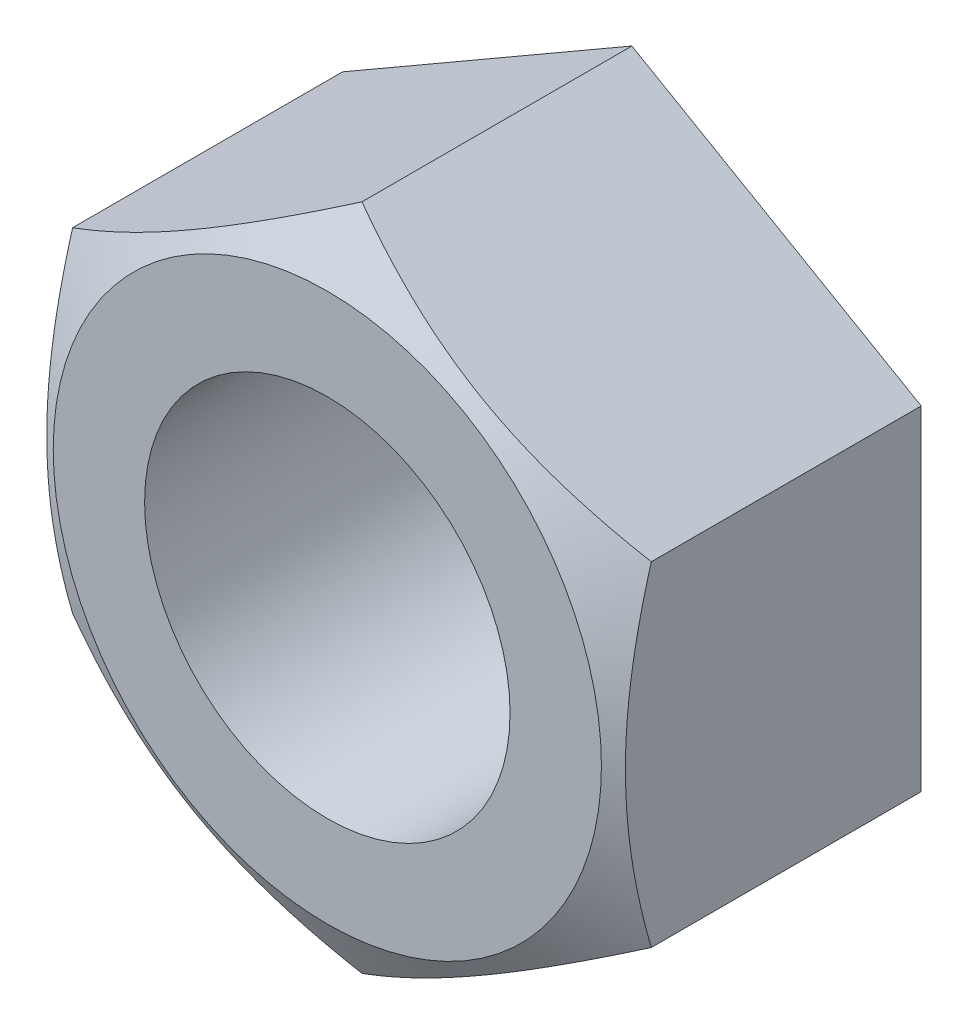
ISO-10303-21;
HEADER;
FILE_DESCRIPTION(('STEP AP214'),'2;1');
FILE_NAME('part.step','',(''),(''),'','','');
FILE_SCHEMA(('AUTOMOTIVE_DESIGN { 1 0 10303 214 1 1 1 1 }'));
ENDSEC;
DATA;
#1=APPLICATION_CONTEXT('core data for automotive mechanical design processes');
#2=APPLICATION_PROTOCOL_DEFINITION('international standard','automotive_design',2000,#1);
#3=PRODUCT_CONTEXT('',#1,'mechanical');
#4=PRODUCT('Part','Part','',(#3));
#5=PRODUCT_RELATED_PRODUCT_CATEGORY('part','',(#4));
#6=PRODUCT_DEFINITION_FORMATION('','',#4);
#7=PRODUCT_DEFINITION_CONTEXT('part definition',#1,'design');
#8=PRODUCT_DEFINITION('design','',#6,#7);
#9=PRODUCT_DEFINITION_SHAPE('','',#8);
#10=(LENGTH_UNIT() NAMED_UNIT(*) SI_UNIT(.MILLI.,.METRE.));
#11=(NAMED_UNIT(*) PLANE_ANGLE_UNIT() SI_UNIT($,.RADIAN.));
#12=(NAMED_UNIT(*) SI_UNIT($,.STERADIAN.) SOLID_ANGLE_UNIT());
#13=UNCERTAINTY_MEASURE_WITH_UNIT(LENGTH_MEASURE(1.E-05),#10,'distance_accuracy_value','');
#14=(GEOMETRIC_REPRESENTATION_CONTEXT(3) GLOBAL_UNCERTAINTY_ASSIGNED_CONTEXT((#13)) GLOBAL_UNIT_ASSIGNED_CONTEXT((#10,
#11,#12)) REPRESENTATION_CONTEXT('',''));
#15=CARTESIAN_POINT('',(0.,0.,0.));
#16=DIRECTION('',(0.,0.,1.));
#17=DIRECTION('',(1.,0.,0.));
#18=AXIS2_PLACEMENT_3D('',#15,#16,#17);
#19=CARTESIAN_POINT('',(-9.5,-5.48482755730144,10.));
#20=DIRECTION('',(-1.,0.,0.));
#21=DIRECTION('',(0.,0.,1.));
#22=AXIS2_PLACEMENT_3D('',#19,#20,#21);
#23=PLANE('',#22);
#24=DIRECTION('',(0.,1.,0.));
#25=VECTOR('',#24,1.);
#26=CARTESIAN_POINT('',(-9.5,-5.48482755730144,0.));
#27=LINE('',#26,#25);
#28=CARTESIAN_POINT('',(-9.5,-5.48482755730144,0.));
#29=VERTEX_POINT('',#28);
#30=CARTESIAN_POINT('',(-9.5,5.48482755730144,0.));
#31=VERTEX_POINT('',#30);
#32=EDGE_CURVE('E90',#29,#31,#27,.T.);
#33=ORIENTED_EDGE('',*,*,#32,.F.);
#34=DIRECTION('',(0.,0.,-1.));
#35=VECTOR('',#34,1.);
#36=CARTESIAN_POINT('',(-9.5,-5.48482755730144,10.));
#37=LINE('',#36,#35);
#38=CARTESIAN_POINT('',(-9.5,-5.48482755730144,8.86281908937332));
#39=VERTEX_POINT('',#38);
#40=EDGE_CURVE('E9',#39,#29,#37,.T.);
#41=ORIENTED_EDGE('',*,*,#40,.F.);
#42=CARTESIAN_POINT('',(-9.5,-14.6203705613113,5.12961982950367));
#43=CARTESIAN_POINT('',(-9.5,-14.4133760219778,5.22982896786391));
#44=CARTESIAN_POINT('',(-9.5,-14.2061355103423,5.32952978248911));
#45=CARTESIAN_POINT('',(-9.5,-13.7911111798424,5.52779940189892));
#46=CARTESIAN_POINT('',(-9.5,-13.5833273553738,5.62636819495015));
#47=CARTESIAN_POINT('',(-9.5,-12.959026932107,5.92023022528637));
#48=CARTESIAN_POINT('',(-9.5,-12.5416243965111,6.11364852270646));
#49=CARTESIAN_POINT('',(-9.5,-11.7016619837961,6.49535955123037));
#50=CARTESIAN_POINT('',(-9.5,-11.279086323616,6.68361763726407));
#51=CARTESIAN_POINT('',(-9.5,-10.4305349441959,7.05228047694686));
#52=CARTESIAN_POINT('',(-9.5,-10.004559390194,7.23268560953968));
#53=CARTESIAN_POINT('',(-9.5,-9.13523598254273,7.58900936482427));
#54=CARTESIAN_POINT('',(-9.5,-8.69175917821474,7.7646151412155));
#55=CARTESIAN_POINT('',(-9.5,-7.79957695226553,8.10226180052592));
#56=CARTESIAN_POINT('',(-9.5,-7.3508709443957,8.26430114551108));
#57=CARTESIAN_POINT('',(-9.5,-6.44838780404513,8.57047760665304));
#58=CARTESIAN_POINT('',(-9.5,-5.99462344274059,8.71465195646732));
#59=CARTESIAN_POINT('',(-9.5,-5.08060402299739,8.98040038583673));
#60=CARTESIAN_POINT('',(-9.5,-4.62035109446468,9.10198170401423));
#61=CARTESIAN_POINT('',(-9.5,-3.69554066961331,9.31598884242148));
#62=CARTESIAN_POINT('',(-9.5,-3.23101965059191,9.40856799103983));
#63=CARTESIAN_POINT('',(-9.5,-2.53009968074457,9.52161967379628));
#64=CARTESIAN_POINT('',(-9.5,-2.29575188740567,9.55500229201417));
#65=CARTESIAN_POINT('',(-9.5,-1.82593015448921,9.61250466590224));
#66=CARTESIAN_POINT('',(-9.5,-1.59045632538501,9.63662531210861));
#67=CARTESIAN_POINT('',(-9.5,-1.12172453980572,9.67482643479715));
#68=CARTESIAN_POINT('',(-9.5,-0.888476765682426,9.68903138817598));
#69=CARTESIAN_POINT('',(-9.5,-0.421589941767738,9.70757316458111));
#70=CARTESIAN_POINT('',(-9.5,-0.187950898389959,9.7119101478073));
#71=CARTESIAN_POINT('',(-9.5,0.279302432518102,9.710612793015));
#72=CARTESIAN_POINT('',(-9.5,0.512916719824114,9.70497837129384));
#73=CARTESIAN_POINT('',(-9.5,0.979703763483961,9.68387374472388));
#74=CARTESIAN_POINT('',(-9.5,1.21287649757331,9.66840305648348));
#75=CARTESIAN_POINT('',(-9.5,1.7767093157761,9.61942455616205));
#76=CARTESIAN_POINT('',(-9.5,2.10695454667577,9.58105864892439));
#77=CARTESIAN_POINT('',(-9.5,2.76492123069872,9.48671274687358));
#78=CARTESIAN_POINT('',(-9.5,3.09264232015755,9.43073026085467));
#79=CARTESIAN_POINT('',(-9.5,3.74527313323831,9.30314290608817));
#80=CARTESIAN_POINT('',(-9.5,4.07018038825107,9.23152552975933));
#81=CARTESIAN_POINT('',(-9.5,4.71670052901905,9.0748470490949));
#82=CARTESIAN_POINT('',(-9.5,5.03831347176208,8.98978617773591));
#83=CARTESIAN_POINT('',(-9.5,5.68526467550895,8.80628787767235));
#84=CARTESIAN_POINT('',(-9.5,6.01053116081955,8.70759912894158));
#85=CARTESIAN_POINT('',(-9.5,6.65785880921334,8.50026912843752));
#86=CARTESIAN_POINT('',(-9.5,6.97991995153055,8.39162781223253));
#87=CARTESIAN_POINT('',(-9.5,7.6210004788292,8.16609623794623));
#88=CARTESIAN_POINT('',(-9.5,7.94002088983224,8.04920888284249));
#89=CARTESIAN_POINT('',(-9.5,8.5754344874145,7.80853638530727));
#90=CARTESIAN_POINT('',(-9.5,8.89182770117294,7.68475131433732));
#91=CARTESIAN_POINT('',(-9.5,9.62350368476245,7.3907636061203));
#92=CARTESIAN_POINT('',(-9.5,10.0379237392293,7.21841738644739));
#93=CARTESIAN_POINT('',(-9.5,10.8633742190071,6.86576825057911));
#94=CARTESIAN_POINT('',(-9.5,11.2744044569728,6.68546489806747));
#95=CARTESIAN_POINT('',(-9.5,12.0936880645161,6.31845543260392));
#96=CARTESIAN_POINT('',(-9.5,12.5019408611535,6.13174804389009));
#97=CARTESIAN_POINT('',(-9.5,13.3160389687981,5.7531881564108));
#98=CARTESIAN_POINT('',(-9.5,13.7218843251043,5.56133575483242));
#99=CARTESIAN_POINT('',(-9.5,14.5319664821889,5.17323028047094));
#100=CARTESIAN_POINT('',(-9.5,14.9362012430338,4.9769729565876));
#101=CARTESIAN_POINT('',(-9.5,15.7429612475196,4.58097715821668));
#102=CARTESIAN_POINT('',(-9.5,16.145486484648,4.38123867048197));
#103=CARTESIAN_POINT('',(-9.5,17.3508043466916,3.77775226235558));
#104=CARTESIAN_POINT('',(-9.5,18.1514351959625,3.36968700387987));
#105=CARTESIAN_POINT('',(-9.5,19.6840581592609,2.5786437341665));
#106=CARTESIAN_POINT('',(-9.5,20.4163776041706,2.19629716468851));
#107=CARTESIAN_POINT('',(-9.5,21.8782922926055,1.42637873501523));
#108=CARTESIAN_POINT('',(-9.5,22.607887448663,1.03880670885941));
#109=CARTESIAN_POINT('',(-9.5,24.0632507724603,0.260571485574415));
#110=CARTESIAN_POINT('',(-9.5,24.7890238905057,-0.130082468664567));
#111=CARTESIAN_POINT('',(-9.5,26.2388196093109,-0.914537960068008));
#112=CARTESIAN_POINT('',(-9.5,26.9628422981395,-1.30833933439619));
#113=CARTESIAN_POINT('',(-9.5,27.686216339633,-1.70332069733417));
#114=B_SPLINE_CURVE_WITH_KNOTS('',3,(#42,#43,#44,#45,#46,#47,#48,#49,#50,#51,#52,#53,#54,#55,
#56,#57,#58,#59,#60,#61,#62,#63,#64,#65,#66,#67,#68,#69,#70,#71,#72,#73,#74,#75,#76,#77,#78,#79,
#80,#81,#82,#83,#84,#85,#86,#87,#88,#89,#90,#91,#92,#93,#94,#95,#96,#97,#98,#99,#100,#101,#102,
#103,#104,#105,#106,#107,#108,#109,#110,#111,#112,#113),.UNSPECIFIED.,.F.,.F.,(4,2,2,2,2,2,2,2,
2,2,2,2,2,2,2,2,2,2,2,2,2,2,2,2,2,2,2,2,2,2,2,2,2,2,2,4),(0.,0.689924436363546,1.37985601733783,
2.7599293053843,4.14770758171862,5.53541881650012,6.9661840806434,8.39711132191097,
9.82500423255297,11.2524388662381,12.6721943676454,13.38218061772,14.0920985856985,
14.7929360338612,15.4937621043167,16.1945940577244,16.8954604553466,17.8923053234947,
18.8892912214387,19.8870776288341,20.8848467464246,21.9043812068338,22.9239222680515,
23.9431061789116,24.9622795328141,26.3086543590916,27.6551031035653,29.0018216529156,
30.348514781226,31.6965687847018,33.0446279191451,35.7404261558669,38.2187752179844,
40.6972031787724,43.1698886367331,45.6424469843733),.UNSPECIFIED.);
#115=CARTESIAN_POINT('',(-9.5,5.48482755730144,8.86281908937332));
#116=VERTEX_POINT('',#115);
#117=EDGE_CURVE('E36',#39,#116,#114,.T.);
#118=ORIENTED_EDGE('',*,*,#117,.T.);
#119=DIRECTION('',(0.,0.,-1.));
#120=VECTOR('',#119,1.);
#121=CARTESIAN_POINT('',(-9.5,5.48482755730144,10.));
#122=LINE('',#121,#120);
#123=EDGE_CURVE('E76',#116,#31,#122,.T.);
#124=ORIENTED_EDGE('',*,*,#123,.T.);
#125=EDGE_LOOP('',(#33,#41,#118,#124));
#126=FACE_BOUND('',#125,.T.);
#127=ADVANCED_FACE('F14',(#126),#23,.T.);
#128=CARTESIAN_POINT('',(-9.5,-5.48482755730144,10.));
#129=DIRECTION('',(0.5,0.86602540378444,0.));
#130=DIRECTION('',(-0.86602540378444,0.5,0.));
#131=AXIS2_PLACEMENT_3D('',#128,#129,#130);
#132=PLANE('',#131);
#133=DIRECTION('',(-0.86602540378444,0.5,0.));
#134=VECTOR('',#133,1.);
#135=CARTESIAN_POINT('',(0.,-10.9696551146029,0.));
#136=LINE('',#135,#134);
#137=CARTESIAN_POINT('',(0.,-10.9696551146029,0.));
#138=VERTEX_POINT('',#137);
#139=EDGE_CURVE('E97',#138,#29,#136,.T.);
#140=ORIENTED_EDGE('',*,*,#139,.F.);
#141=DIRECTION('',(0.,0.,-1.));
#142=VECTOR('',#141,1.);
#143=CARTESIAN_POINT('',(0.,-10.9696551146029,10.));
#144=LINE('',#143,#142);
#145=CARTESIAN_POINT('',(0.,-10.9696551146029,8.86281908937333));
#146=VERTEX_POINT('',#145);
#147=EDGE_CURVE('E23',#146,#138,#144,.T.);
#148=ORIENTED_EDGE('',*,*,#147,.F.);
#149=CARTESIAN_POINT('',(-9.5002,-5.4847120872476,8.86275242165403));
#150=CARTESIAN_POINT('',(-9.2913692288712,-5.60528058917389,8.93235142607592));
#151=CARTESIAN_POINT('',(-9.08175982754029,-5.72629863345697,8.99879155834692));
#152=CARTESIAN_POINT('',(-8.66086011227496,-5.96930519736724,9.1244775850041));
#153=CARTESIAN_POINT('',(-8.44956926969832,-6.09129402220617,9.18372111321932));
#154=CARTESIAN_POINT('',(-7.81229220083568,-6.45922610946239,9.34951029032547));
#155=CARTESIAN_POINT('',(-7.38379023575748,-6.70662183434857,9.4438104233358));
#156=CARTESIAN_POINT('',(-6.74255666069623,-7.07683821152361,9.55438616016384));
#157=CARTESIAN_POINT('',(-6.53174078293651,-7.19855281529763,9.58588503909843));
#158=CARTESIAN_POINT('',(-6.10913296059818,-7.4425455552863,9.63870666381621));
#159=CARTESIAN_POINT('',(-5.89734099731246,-7.56482370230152,9.66002921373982));
#160=CARTESIAN_POINT('',(-5.47340378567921,-7.80958396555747,9.69195184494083));
#161=CARTESIAN_POINT('',(-5.26125925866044,-7.93206566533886,9.70256466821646));
#162=CARTESIAN_POINT('',(-4.83677424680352,-8.17714220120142,9.71284233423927));
#163=CARTESIAN_POINT('',(-4.62443376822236,-8.2997370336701,9.71250751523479));
#164=CARTESIAN_POINT('',(-4.22745800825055,-8.52893109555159,9.70165149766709));
#165=CARTESIAN_POINT('',(-4.04279470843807,-8.63554650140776,9.69245459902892));
#166=CARTESIAN_POINT('',(-3.67389999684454,-8.84852796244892,9.66595946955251));
#167=CARTESIAN_POINT('',(-3.48966861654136,-8.95489399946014,9.64866066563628));
#168=CARTESIAN_POINT('',(-2.937688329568,-9.27357996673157,9.58502038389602));
#169=CARTESIAN_POINT('',(-2.57091646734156,-9.48533580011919,9.52694296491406));
#170=CARTESIAN_POINT('',(-1.83348217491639,-9.91109368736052,9.38174885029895));
#171=CARTESIAN_POINT('',(-1.46291385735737,-10.1250414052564,9.29401669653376));
#172=CARTESIAN_POINT('',(-0.727303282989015,-10.5497463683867,9.09490112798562));
#173=CARTESIAN_POINT('',(-0.36225160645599,-10.7605090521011,8.98356447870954));
#174=CARTESIAN_POINT('',(0.000200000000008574,-10.9697705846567,8.86275242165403));
#175=B_SPLINE_CURVE_WITH_KNOTS('',3,(#149,#150,#151,#152,#153,#154,#155,#156,#157,#158,#159,
#160,#161,#162,#163,#164,#165,#166,#167,#168,#169,#170,#171,#172,#173,#174),.UNSPECIFIED.,.F.,
.F.,(4,2,2,2,2,2,2,2,2,2,2,2,4),(0.,0.752880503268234,1.50600787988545,3.0154687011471,
3.75167336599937,4.48789219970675,5.22323407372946,5.95855322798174,6.5986808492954,
7.23885375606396,8.52010929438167,9.82978009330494,11.1368800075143),.UNSPECIFIED.);
#176=EDGE_CURVE('E144',#39,#146,#175,.T.);
#177=ORIENTED_EDGE('',*,*,#176,.F.);
#178=ORIENTED_EDGE('',*,*,#40,.T.);
#179=EDGE_LOOP('',(#140,#148,#177,#178));
#180=FACE_BOUND('',#179,.T.);
#181=ADVANCED_FACE('F16',(#180),#132,.F.);
#182=CARTESIAN_POINT('',(9.5,-5.48482755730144,10.));
#183=DIRECTION('',(0.5,-0.86602540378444,0.));
#184=DIRECTION('',(0.86602540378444,0.5,0.));
#185=AXIS2_PLACEMENT_3D('',#182,#183,#184);
#186=PLANE('',#185);
#187=DIRECTION('',(-0.866025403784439,-0.5,0.));
#188=VECTOR('',#187,1.);
#189=CARTESIAN_POINT('',(9.5,-5.48482755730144,0.));
#190=LINE('',#189,#188);
#191=CARTESIAN_POINT('',(9.5,-5.48482755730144,0.));
#192=VERTEX_POINT('',#191);
#193=EDGE_CURVE('E94',#192,#138,#190,.T.);
#194=ORIENTED_EDGE('',*,*,#193,.F.);
#195=DIRECTION('',(0.,0.,-1.));
#196=VECTOR('',#195,1.);
#197=CARTESIAN_POINT('',(9.5,-5.48482755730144,10.));
#198=LINE('',#197,#196);
#199=CARTESIAN_POINT('',(9.5,-5.48482755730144,8.86281908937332));
#200=VERTEX_POINT('',#199);
#201=EDGE_CURVE('E178',#200,#192,#198,.T.);
#202=ORIENTED_EDGE('',*,*,#201,.F.);
#203=CARTESIAN_POINT('',(9.5002,-5.4847120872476,8.86275242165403));
#204=CARTESIAN_POINT('',(9.2913692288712,-5.60528058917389,8.93235142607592));
#205=CARTESIAN_POINT('',(9.08175982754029,-5.72629863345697,8.99879155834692));
#206=CARTESIAN_POINT('',(8.66086011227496,-5.96930519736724,9.1244775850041));
#207=CARTESIAN_POINT('',(8.44956926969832,-6.09129402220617,9.18372111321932));
#208=CARTESIAN_POINT('',(7.81229220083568,-6.45922610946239,9.34951029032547));
#209=CARTESIAN_POINT('',(7.38379023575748,-6.70662183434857,9.4438104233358));
#210=CARTESIAN_POINT('',(6.74255666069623,-7.07683821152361,9.55438616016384));
#211=CARTESIAN_POINT('',(6.53174078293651,-7.19855281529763,9.58588503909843));
#212=CARTESIAN_POINT('',(6.10913296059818,-7.4425455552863,9.63870666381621));
#213=CARTESIAN_POINT('',(5.89734099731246,-7.56482370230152,9.66002921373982));
#214=CARTESIAN_POINT('',(5.47340378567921,-7.80958396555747,9.69195184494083));
#215=CARTESIAN_POINT('',(5.26125925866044,-7.93206566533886,9.70256466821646));
#216=CARTESIAN_POINT('',(4.83677424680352,-8.17714220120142,9.71284233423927));
#217=CARTESIAN_POINT('',(4.62443376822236,-8.2997370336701,9.71250751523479));
#218=CARTESIAN_POINT('',(4.22745800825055,-8.52893109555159,9.70165149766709));
#219=CARTESIAN_POINT('',(4.04279470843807,-8.63554650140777,9.69245459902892));
#220=CARTESIAN_POINT('',(3.67389999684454,-8.84852796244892,9.66595946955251));
#221=CARTESIAN_POINT('',(3.48966861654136,-8.95489399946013,9.64866066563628));
#222=CARTESIAN_POINT('',(2.937688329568,-9.27357996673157,9.58502038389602));
#223=CARTESIAN_POINT('',(2.57091646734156,-9.48533580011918,9.52694296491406));
#224=CARTESIAN_POINT('',(1.83348217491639,-9.91109368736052,9.38174885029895));
#225=CARTESIAN_POINT('',(1.46291385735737,-10.1250414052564,9.29401669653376));
#226=CARTESIAN_POINT('',(0.727303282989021,-10.5497463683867,9.09490112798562));
#227=CARTESIAN_POINT('',(0.362251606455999,-10.7605090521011,8.98356447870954));
#228=CARTESIAN_POINT('',(-0.000200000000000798,-10.9697705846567,8.86275242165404));
#229=B_SPLINE_CURVE_WITH_KNOTS('',3,(#203,#204,#205,#206,#207,#208,#209,#210,#211,#212,#213,
#214,#215,#216,#217,#218,#219,#220,#221,#222,#223,#224,#225,#226,#227,#228),.UNSPECIFIED.,.F.,
.F.,(4,2,2,2,2,2,2,2,2,2,2,2,4),(0.,0.752880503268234,1.50600787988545,3.0154687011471,
3.75167336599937,4.48789219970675,5.22323407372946,5.95855322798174,6.5986808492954,
7.23885375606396,8.52010929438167,9.82978009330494,11.1368800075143),.UNSPECIFIED.);
#230=EDGE_CURVE('E138',#200,#146,#229,.T.);
#231=ORIENTED_EDGE('',*,*,#230,.T.);
#232=ORIENTED_EDGE('',*,*,#147,.T.);
#233=EDGE_LOOP('',(#194,#202,#231,#232));
#234=FACE_BOUND('',#233,.T.);
#235=ADVANCED_FACE('F184',(#234),#186,.T.);
#236=CARTESIAN_POINT('',(9.5,-5.48482755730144,10.));
#237=DIRECTION('',(-1.,0.,0.));
#238=DIRECTION('',(0.,0.,1.));
#239=AXIS2_PLACEMENT_3D('',#236,#237,#238);
#240=PLANE('',#239);
#241=DIRECTION('',(0.,-1.,0.));
#242=VECTOR('',#241,1.);
#243=CARTESIAN_POINT('',(9.5,5.48482755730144,0.));
#244=LINE('',#243,#242);
#245=CARTESIAN_POINT('',(9.5,5.48482755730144,0.));
#246=VERTEX_POINT('',#245);
#247=EDGE_CURVE('E85',#246,#192,#244,.T.);
#248=ORIENTED_EDGE('',*,*,#247,.F.);
#249=DIRECTION('',(0.,0.,-1.));
#250=VECTOR('',#249,1.);
#251=CARTESIAN_POINT('',(9.5,5.48482755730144,10.));
#252=LINE('',#251,#250);
#253=CARTESIAN_POINT('',(9.5,5.48482755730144,8.86281908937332));
#254=VERTEX_POINT('',#253);
#255=EDGE_CURVE('E75',#254,#246,#252,.T.);
#256=ORIENTED_EDGE('',*,*,#255,.F.);
#257=CARTESIAN_POINT('',(9.5,-14.6203705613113,5.12961982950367));
#258=CARTESIAN_POINT('',(9.5,-14.4133760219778,5.22982896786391));
#259=CARTESIAN_POINT('',(9.5,-14.2061355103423,5.32952978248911));
#260=CARTESIAN_POINT('',(9.5,-13.7911111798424,5.52779940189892));
#261=CARTESIAN_POINT('',(9.5,-13.5833273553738,5.62636819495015));
#262=CARTESIAN_POINT('',(9.5,-12.959026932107,5.92023022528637));
#263=CARTESIAN_POINT('',(9.5,-12.5416243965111,6.11364852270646));
#264=CARTESIAN_POINT('',(9.5,-11.7016619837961,6.49535955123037));
#265=CARTESIAN_POINT('',(9.5,-11.279086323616,6.68361763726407));
#266=CARTESIAN_POINT('',(9.5,-10.4305349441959,7.05228047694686));
#267=CARTESIAN_POINT('',(9.5,-10.004559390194,7.23268560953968));
#268=CARTESIAN_POINT('',(9.5,-9.13523598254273,7.58900936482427));
#269=CARTESIAN_POINT('',(9.5,-8.69175917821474,7.7646151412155));
#270=CARTESIAN_POINT('',(9.5,-7.79957695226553,8.10226180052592));
#271=CARTESIAN_POINT('',(9.5,-7.3508709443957,8.26430114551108));
#272=CARTESIAN_POINT('',(9.5,-6.44838780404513,8.57047760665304));
#273=CARTESIAN_POINT('',(9.5,-5.99462344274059,8.71465195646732));
#274=CARTESIAN_POINT('',(9.5,-5.08060402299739,8.98040038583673));
#275=CARTESIAN_POINT('',(9.5,-4.62035109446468,9.10198170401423));
#276=CARTESIAN_POINT('',(9.5,-3.69554066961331,9.31598884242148));
#277=CARTESIAN_POINT('',(9.5,-3.23101965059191,9.40856799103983));
#278=CARTESIAN_POINT('',(9.5,-2.53009968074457,9.52161967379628));
#279=CARTESIAN_POINT('',(9.5,-2.29575188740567,9.55500229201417));
#280=CARTESIAN_POINT('',(9.5,-1.82593015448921,9.61250466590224));
#281=CARTESIAN_POINT('',(9.5,-1.59045632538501,9.63662531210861));
#282=CARTESIAN_POINT('',(9.5,-1.12172453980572,9.67482643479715));
#283=CARTESIAN_POINT('',(9.5,-0.888476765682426,9.68903138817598));
#284=CARTESIAN_POINT('',(9.5,-0.421589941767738,9.70757316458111));
#285=CARTESIAN_POINT('',(9.5,-0.187950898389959,9.7119101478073));
#286=CARTESIAN_POINT('',(9.5,0.279302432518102,9.710612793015));
#287=CARTESIAN_POINT('',(9.5,0.512916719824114,9.70497837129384));
#288=CARTESIAN_POINT('',(9.5,0.979703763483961,9.68387374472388));
#289=CARTESIAN_POINT('',(9.5,1.21287649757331,9.66840305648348));
#290=CARTESIAN_POINT('',(9.5,1.7767093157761,9.61942455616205));
#291=CARTESIAN_POINT('',(9.5,2.10695454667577,9.58105864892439));
#292=CARTESIAN_POINT('',(9.5,2.76492123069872,9.48671274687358));
#293=CARTESIAN_POINT('',(9.5,3.09264232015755,9.43073026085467));
#294=CARTESIAN_POINT('',(9.5,3.74527313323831,9.30314290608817));
#295=CARTESIAN_POINT('',(9.5,4.07018038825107,9.23152552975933));
#296=CARTESIAN_POINT('',(9.5,4.71670052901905,9.0748470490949));
#297=CARTESIAN_POINT('',(9.5,5.03831347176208,8.98978617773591));
#298=CARTESIAN_POINT('',(9.5,5.68526467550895,8.80628787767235));
#299=CARTESIAN_POINT('',(9.5,6.01053116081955,8.70759912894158));
#300=CARTESIAN_POINT('',(9.5,6.65785880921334,8.50026912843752));
#301=CARTESIAN_POINT('',(9.5,6.97991995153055,8.39162781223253));
#302=CARTESIAN_POINT('',(9.5,7.6210004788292,8.16609623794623));
#303=CARTESIAN_POINT('',(9.5,7.94002088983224,8.04920888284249));
#304=CARTESIAN_POINT('',(9.5,8.5754344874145,7.80853638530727));
#305=CARTESIAN_POINT('',(9.5,8.89182770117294,7.68475131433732));
#306=CARTESIAN_POINT('',(9.5,9.62350368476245,7.3907636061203));
#307=CARTESIAN_POINT('',(9.5,10.0379237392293,7.21841738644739));
#308=CARTESIAN_POINT('',(9.5,10.8633742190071,6.86576825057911));
#309=CARTESIAN_POINT('',(9.5,11.2744044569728,6.68546489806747));
#310=CARTESIAN_POINT('',(9.5,12.0936880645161,6.31845543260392));
#311=CARTESIAN_POINT('',(9.5,12.5019408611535,6.13174804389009));
#312=CARTESIAN_POINT('',(9.5,13.3160389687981,5.7531881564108));
#313=CARTESIAN_POINT('',(9.5,13.7218843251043,5.56133575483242));
#314=CARTESIAN_POINT('',(9.5,14.5319664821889,5.17323028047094));
#315=CARTESIAN_POINT('',(9.5,14.9362012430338,4.9769729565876));
#316=CARTESIAN_POINT('',(9.5,15.7429612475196,4.58097715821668));
#317=CARTESIAN_POINT('',(9.5,16.145486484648,4.38123867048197));
#318=CARTESIAN_POINT('',(9.5,17.3508043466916,3.77775226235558));
#319=CARTESIAN_POINT('',(9.5,18.1514351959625,3.36968700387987));
#320=CARTESIAN_POINT('',(9.5,19.6840581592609,2.5786437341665));
#321=CARTESIAN_POINT('',(9.5,20.4163776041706,2.19629716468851));
#322=CARTESIAN_POINT('',(9.5,21.8782922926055,1.42637873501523));
#323=CARTESIAN_POINT('',(9.5,22.607887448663,1.03880670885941));
#324=CARTESIAN_POINT('',(9.5,24.0632507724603,0.260571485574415));
#325=CARTESIAN_POINT('',(9.5,24.7890238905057,-0.130082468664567));
#326=CARTESIAN_POINT('',(9.5,26.2388196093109,-0.914537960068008));
#327=CARTESIAN_POINT('',(9.5,26.9628422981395,-1.30833933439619));
#328=CARTESIAN_POINT('',(9.5,27.686216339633,-1.70332069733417));
#329=B_SPLINE_CURVE_WITH_KNOTS('',3,(#257,#258,#259,#260,#261,#262,#263,#264,#265,#266,#267,
#268,#269,#270,#271,#272,#273,#274,#275,#276,#277,#278,#279,#280,#281,#282,#283,#284,#285,#286,
#287,#288,#289,#290,#291,#292,#293,#294,#295,#296,#297,#298,#299,#300,#301,#302,#303,#304,#305,
#306,#307,#308,#309,#310,#311,#312,#313,#314,#315,#316,#317,#318,#319,#320,#321,#322,#323,#324,
#325,#326,#327,#328),.UNSPECIFIED.,.F.,.F.,(4,2,2,2,2,2,2,2,2,2,2,2,2,2,2,2,2,2,2,2,2,2,2,2,2,2,
2,2,2,2,2,2,2,2,2,4),(0.,0.689924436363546,1.37985601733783,2.7599293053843,4.14770758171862,
5.53541881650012,6.9661840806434,8.39711132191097,9.82500423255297,11.2524388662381,
12.6721943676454,13.38218061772,14.0920985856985,14.7929360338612,15.4937621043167,
16.1945940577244,16.8954604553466,17.8923053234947,18.8892912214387,19.8870776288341,
20.8848467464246,21.9043812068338,22.9239222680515,23.9431061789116,24.9622795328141,
26.3086543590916,27.6551031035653,29.0018216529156,30.348514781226,31.6965687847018,
33.0446279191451,35.7404261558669,38.2187752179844,40.6972031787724,43.1698886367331,
45.6424469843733),.UNSPECIFIED.);
#330=EDGE_CURVE('E131',#200,#254,#329,.T.);
#331=ORIENTED_EDGE('',*,*,#330,.F.);
#332=ORIENTED_EDGE('',*,*,#201,.T.);
#333=EDGE_LOOP('',(#248,#256,#331,#332));
#334=FACE_BOUND('',#333,.T.);
#335=ADVANCED_FACE('F189',(#334),#240,.F.);
#336=CARTESIAN_POINT('',(9.5,5.48482755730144,10.));
#337=DIRECTION('',(-0.5,-0.86602540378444,0.));
#338=DIRECTION('',(0.86602540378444,-0.5,0.));
#339=AXIS2_PLACEMENT_3D('',#336,#337,#338);
#340=PLANE('',#339);
#341=DIRECTION('',(0.86602540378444,-0.5,0.));
#342=VECTOR('',#341,1.);
#343=CARTESIAN_POINT('',(0.,10.9696551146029,0.));
#344=LINE('',#343,#342);
#345=CARTESIAN_POINT('',(0.,10.9696551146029,0.));
#346=VERTEX_POINT('',#345);
#347=EDGE_CURVE('E79',#346,#246,#344,.T.);
#348=ORIENTED_EDGE('',*,*,#347,.F.);
#349=DIRECTION('',(0.,0.,-1.));
#350=VECTOR('',#349,1.);
#351=CARTESIAN_POINT('',(0.,10.9696551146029,10.));
#352=LINE('',#351,#350);
#353=CARTESIAN_POINT('',(0.,10.9696551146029,8.86281908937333));
#354=VERTEX_POINT('',#353);
#355=EDGE_CURVE('E66',#354,#346,#352,.T.);
#356=ORIENTED_EDGE('',*,*,#355,.F.);
#357=CARTESIAN_POINT('',(9.5002,5.4847120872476,8.86275242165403));
#358=CARTESIAN_POINT('',(9.2913692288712,5.60528058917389,8.93235142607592));
#359=CARTESIAN_POINT('',(9.08175982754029,5.72629863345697,8.99879155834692));
#360=CARTESIAN_POINT('',(8.66086011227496,5.96930519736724,9.1244775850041));
#361=CARTESIAN_POINT('',(8.44956926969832,6.09129402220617,9.18372111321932));
#362=CARTESIAN_POINT('',(7.81229220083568,6.45922610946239,9.34951029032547));
#363=CARTESIAN_POINT('',(7.38379023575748,6.70662183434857,9.4438104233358));
#364=CARTESIAN_POINT('',(6.74255666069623,7.07683821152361,9.55438616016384));
#365=CARTESIAN_POINT('',(6.53174078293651,7.19855281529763,9.58588503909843));
#366=CARTESIAN_POINT('',(6.10913296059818,7.4425455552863,9.63870666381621));
#367=CARTESIAN_POINT('',(5.89734099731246,7.56482370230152,9.66002921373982));
#368=CARTESIAN_POINT('',(5.47340378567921,7.80958396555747,9.69195184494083));
#369=CARTESIAN_POINT('',(5.26125925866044,7.93206566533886,9.70256466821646));
#370=CARTESIAN_POINT('',(4.83677424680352,8.17714220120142,9.71284233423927));
#371=CARTESIAN_POINT('',(4.62443376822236,8.2997370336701,9.71250751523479));
#372=CARTESIAN_POINT('',(4.22745800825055,8.52893109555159,9.70165149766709));
#373=CARTESIAN_POINT('',(4.04279470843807,8.63554650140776,9.69245459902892));
#374=CARTESIAN_POINT('',(3.67389999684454,8.84852796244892,9.66595946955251));
#375=CARTESIAN_POINT('',(3.48966861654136,8.95489399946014,9.64866066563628));
#376=CARTESIAN_POINT('',(2.937688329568,9.27357996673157,9.58502038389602));
#377=CARTESIAN_POINT('',(2.57091646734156,9.48533580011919,9.52694296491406));
#378=CARTESIAN_POINT('',(1.83348217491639,9.91109368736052,9.38174885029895));
#379=CARTESIAN_POINT('',(1.46291385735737,10.1250414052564,9.29401669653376));
#380=CARTESIAN_POINT('',(0.727303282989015,10.5497463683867,9.09490112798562));
#381=CARTESIAN_POINT('',(0.36225160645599,10.7605090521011,8.98356447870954));
#382=CARTESIAN_POINT('',(-0.000200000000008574,10.9697705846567,8.86275242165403));
#383=B_SPLINE_CURVE_WITH_KNOTS('',3,(#357,#358,#359,#360,#361,#362,#363,#364,#365,#366,#367,
#368,#369,#370,#371,#372,#373,#374,#375,#376,#377,#378,#379,#380,#381,#382),.UNSPECIFIED.,.F.,
.F.,(4,2,2,2,2,2,2,2,2,2,2,2,4),(0.,0.752880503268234,1.50600787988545,3.0154687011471,
3.75167336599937,4.48789219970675,5.22323407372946,5.95855322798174,6.5986808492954,
7.23885375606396,8.52010929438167,9.82978009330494,11.1368800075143),.UNSPECIFIED.);
#384=EDGE_CURVE('E30',#254,#354,#383,.T.);
#385=ORIENTED_EDGE('',*,*,#384,.F.);
#386=ORIENTED_EDGE('',*,*,#255,.T.);
#387=EDGE_LOOP('',(#348,#356,#385,#386));
#388=FACE_BOUND('',#387,.T.);
#389=ADVANCED_FACE('F80',(#388),#340,.F.);
#390=CARTESIAN_POINT('',(-9.5,5.48482755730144,10.));
#391=DIRECTION('',(-0.5,0.86602540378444,0.));
#392=DIRECTION('',(-0.86602540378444,-0.5,0.));
#393=AXIS2_PLACEMENT_3D('',#390,#391,#392);
#394=PLANE('',#393);
#395=DIRECTION('',(0.866025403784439,0.5,0.));
#396=VECTOR('',#395,1.);
#397=CARTESIAN_POINT('',(-9.5,5.48482755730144,0.));
#398=LINE('',#397,#396);
#399=EDGE_CURVE('E71',#31,#346,#398,.T.);
#400=ORIENTED_EDGE('',*,*,#399,.F.);
#401=ORIENTED_EDGE('',*,*,#123,.F.);
#402=CARTESIAN_POINT('',(-9.5002,5.4847120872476,8.86275242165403));
#403=CARTESIAN_POINT('',(-9.2913692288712,5.60528058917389,8.93235142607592));
#404=CARTESIAN_POINT('',(-9.08175982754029,5.72629863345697,8.99879155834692));
#405=CARTESIAN_POINT('',(-8.66086011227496,5.96930519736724,9.1244775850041));
#406=CARTESIAN_POINT('',(-8.44956926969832,6.09129402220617,9.18372111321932));
#407=CARTESIAN_POINT('',(-7.81229220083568,6.45922610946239,9.34951029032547));
#408=CARTESIAN_POINT('',(-7.38379023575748,6.70662183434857,9.4438104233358));
#409=CARTESIAN_POINT('',(-6.74255666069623,7.07683821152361,9.55438616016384));
#410=CARTESIAN_POINT('',(-6.53174078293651,7.19855281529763,9.58588503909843));
#411=CARTESIAN_POINT('',(-6.10913296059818,7.4425455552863,9.63870666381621));
#412=CARTESIAN_POINT('',(-5.89734099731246,7.56482370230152,9.66002921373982));
#413=CARTESIAN_POINT('',(-5.47340378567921,7.80958396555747,9.69195184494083));
#414=CARTESIAN_POINT('',(-5.26125925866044,7.93206566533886,9.70256466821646));
#415=CARTESIAN_POINT('',(-4.83677424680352,8.17714220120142,9.71284233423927));
#416=CARTESIAN_POINT('',(-4.62443376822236,8.2997370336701,9.71250751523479));
#417=CARTESIAN_POINT('',(-4.22745800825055,8.52893109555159,9.70165149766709));
#418=CARTESIAN_POINT('',(-4.04279470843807,8.63554650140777,9.69245459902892));
#419=CARTESIAN_POINT('',(-3.67389999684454,8.84852796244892,9.66595946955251));
#420=CARTESIAN_POINT('',(-3.48966861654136,8.95489399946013,9.64866066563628));
#421=CARTESIAN_POINT('',(-2.937688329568,9.27357996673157,9.58502038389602));
#422=CARTESIAN_POINT('',(-2.57091646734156,9.48533580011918,9.52694296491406));
#423=CARTESIAN_POINT('',(-1.83348217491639,9.91109368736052,9.38174885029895));
#424=CARTESIAN_POINT('',(-1.46291385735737,10.1250414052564,9.29401669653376));
#425=CARTESIAN_POINT('',(-0.727303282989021,10.5497463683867,9.09490112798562));
#426=CARTESIAN_POINT('',(-0.362251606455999,10.7605090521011,8.98356447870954));
#427=CARTESIAN_POINT('',(0.000200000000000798,10.9697705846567,8.86275242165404));
#428=B_SPLINE_CURVE_WITH_KNOTS('',3,(#402,#403,#404,#405,#406,#407,#408,#409,#410,#411,#412,
#413,#414,#415,#416,#417,#418,#419,#420,#421,#422,#423,#424,#425,#426,#427),.UNSPECIFIED.,.F.,
.F.,(4,2,2,2,2,2,2,2,2,2,2,2,4),(0.,0.752880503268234,1.50600787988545,3.0154687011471,
3.75167336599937,4.48789219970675,5.22323407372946,5.95855322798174,6.5986808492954,
7.23885375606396,8.52010929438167,9.82978009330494,11.1368800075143),.UNSPECIFIED.);
#429=EDGE_CURVE('E73',#116,#354,#428,.T.);
#430=ORIENTED_EDGE('',*,*,#429,.T.);
#431=ORIENTED_EDGE('',*,*,#355,.T.);
#432=EDGE_LOOP('',(#400,#401,#430,#431));
#433=FACE_BOUND('',#432,.T.);
#434=ADVANCED_FACE('F68',(#433),#394,.T.);
#435=CARTESIAN_POINT('',(-9.5,5.48482755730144,10.));
#436=DIRECTION('',(0.,0.,1.));
#437=DIRECTION('',(1.,0.,0.));
#438=AXIS2_PLACEMENT_3D('',#435,#436,#437);
#439=PLANE('',#438);
#440=CARTESIAN_POINT('',(0.,0.,10.));
#441=DIRECTION('',(0.,0.,1.));
#442=DIRECTION('',(1.,0.,0.));
#443=AXIS2_PLACEMENT_3D('',#440,#441,#442);
#444=CIRCLE('',#443,6.);
#445=CARTESIAN_POINT('',(6.,0.,10.));
#446=VERTEX_POINT('',#445);
#447=EDGE_CURVE('E154',#446,#446,#444,.T.);
#448=ORIENTED_EDGE('',*,*,#447,.F.);
#449=EDGE_LOOP('',(#448));
#450=FACE_BOUND('',#449,.T.);
#451=CARTESIAN_POINT('',(0.,0.,10.));
#452=DIRECTION('',(0.,0.,1.));
#453=DIRECTION('',(1.,0.,0.));
#454=AXIS2_PLACEMENT_3D('',#451,#452,#453);
#455=CIRCLE('',#454,9.);
#456=CARTESIAN_POINT('',(9.,0.,10.));
#457=VERTEX_POINT('',#456);
#458=EDGE_CURVE('E100',#457,#457,#455,.T.);
#459=ORIENTED_EDGE('',*,*,#458,.T.);
#460=EDGE_LOOP('',(#459));
#461=FACE_BOUND('',#460,.T.);
#462=ADVANCED_FACE('F123',(#450,#461),#439,.T.);
#463=CARTESIAN_POINT('',(-9.5,5.48482755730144,0.));
#464=DIRECTION('',(0.,0.,-1.));
#465=DIRECTION('',(0.,-1.,0.));
#466=AXIS2_PLACEMENT_3D('',#463,#464,#465);
#467=PLANE('',#466);
#468=CARTESIAN_POINT('',(0.,0.,0.));
#469=DIRECTION('',(0.,0.,-1.));
#470=DIRECTION('',(0.,-1.,0.));
#471=AXIS2_PLACEMENT_3D('',#468,#469,#470);
#472=CIRCLE('',#471,6.);
#473=CARTESIAN_POINT('',(0.,-6.,0.));
#474=VERTEX_POINT('',#473);
#475=EDGE_CURVE('E171',#474,#474,#472,.T.);
#476=ORIENTED_EDGE('',*,*,#475,.F.);
#477=EDGE_LOOP('',(#476));
#478=FACE_BOUND('',#477,.T.);
#479=ORIENTED_EDGE('',*,*,#399,.T.);
#480=ORIENTED_EDGE('',*,*,#347,.T.);
#481=ORIENTED_EDGE('',*,*,#247,.T.);
#482=ORIENTED_EDGE('',*,*,#193,.T.);
#483=ORIENTED_EDGE('',*,*,#139,.T.);
#484=ORIENTED_EDGE('',*,*,#32,.T.);
#485=EDGE_LOOP('',(#479,#480,#481,#482,#483,#484));
#486=FACE_BOUND('',#485,.T.);
#487=ADVANCED_FACE('F87',(#478,#486),#467,.T.);
#488=CARTESIAN_POINT('',(0.,0.,10.));
#489=DIRECTION('',(0.,0.,-1.));
#490=DIRECTION('',(0.,-1.,0.));
#491=AXIS2_PLACEMENT_3D('',#488,#489,#490);
#492=CYLINDRICAL_SURFACE('',#491,6.);
#493=ORIENTED_EDGE('',*,*,#475,.T.);
#494=EDGE_LOOP('',(#493));
#495=FACE_BOUND('',#494,.T.);
#496=ORIENTED_EDGE('',*,*,#447,.T.);
#497=EDGE_LOOP('',(#496));
#498=FACE_BOUND('',#497,.T.);
#499=ADVANCED_FACE('F122',(#495,#498),#492,.F.);
#500=CARTESIAN_POINT('',(0.,0.,10.));
#501=DIRECTION('',(0.,0.,-1.));
#502=DIRECTION('',(-1.,0.,0.));
#503=AXIS2_PLACEMENT_3D('',#500,#501,#502);
#504=CONICAL_SURFACE('',#503,9.,1.0471975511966);
#505=ORIENTED_EDGE('',*,*,#176,.T.);
#506=ORIENTED_EDGE('',*,*,#230,.F.);
#507=ORIENTED_EDGE('',*,*,#330,.T.);
#508=ORIENTED_EDGE('',*,*,#384,.T.);
#509=ORIENTED_EDGE('',*,*,#429,.F.);
#510=ORIENTED_EDGE('',*,*,#117,.F.);
#511=EDGE_LOOP('',(#505,#506,#507,#508,#509,#510));
#512=FACE_BOUND('',#511,.T.);
#513=ORIENTED_EDGE('',*,*,#458,.F.);
#514=EDGE_LOOP('',(#513));
#515=FACE_BOUND('',#514,.T.);
#516=ADVANCED_FACE('F118',(#512,#515),#504,.T.);
#517=CLOSED_SHELL('',(#127,#181,#235,#335,#389,#434,#462,#487,#499,#516));
#518=MANIFOLD_SOLID_BREP('B1',#517);
#519=ADVANCED_BREP_SHAPE_REPRESENTATION('',(#18,#518),#14);
#520=SHAPE_DEFINITION_REPRESENTATION(#9,#519);
ENDSEC;
END-ISO-10303-21;
